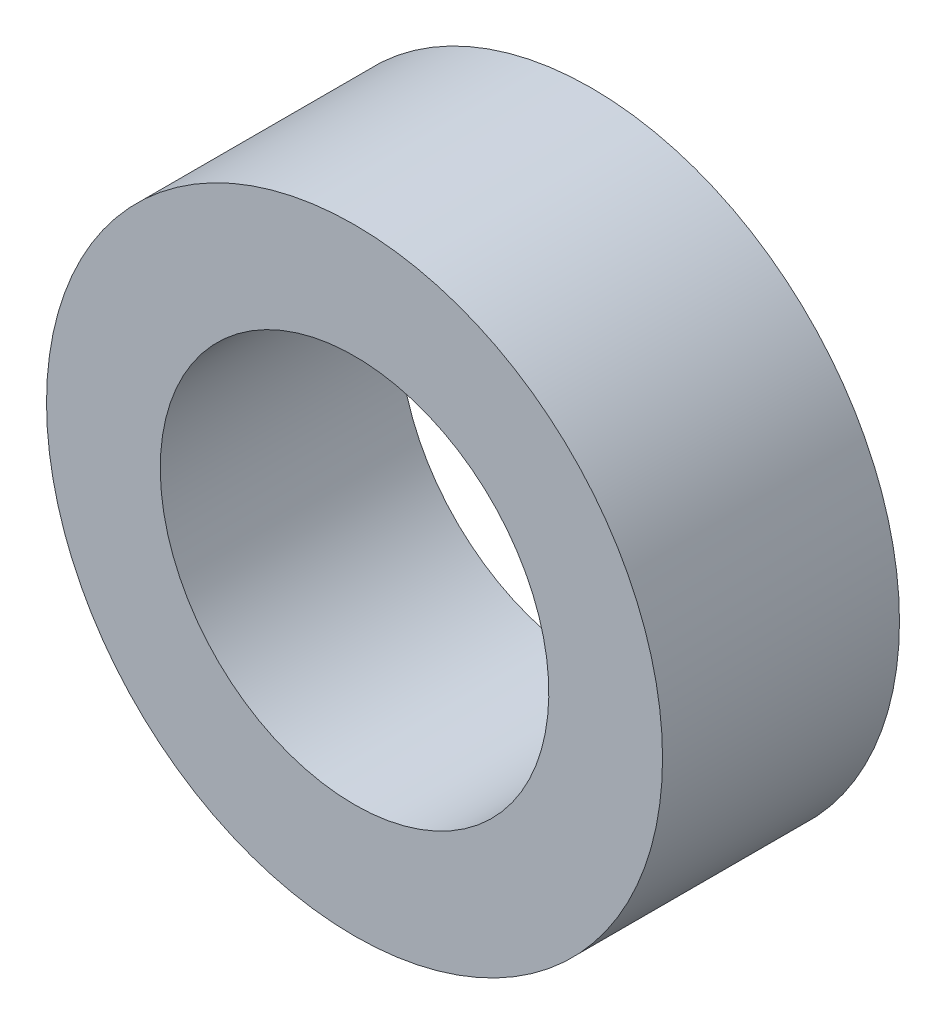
ISO-10303-21;
HEADER;
FILE_DESCRIPTION(('STEP AP214'),'2;1');
FILE_NAME('part.step','',(''),(''),'','','');
FILE_SCHEMA(('AUTOMOTIVE_DESIGN { 1 0 10303 214 1 1 1 1 }'));
ENDSEC;
DATA;
#1=APPLICATION_CONTEXT('core data for automotive mechanical design processes');
#2=APPLICATION_PROTOCOL_DEFINITION('international standard','automotive_design',2000,#1);
#3=PRODUCT_CONTEXT('',#1,'mechanical');
#4=PRODUCT('Part','Part','',(#3));
#5=PRODUCT_RELATED_PRODUCT_CATEGORY('part','',(#4));
#6=PRODUCT_DEFINITION_FORMATION('','',#4);
#7=PRODUCT_DEFINITION_CONTEXT('part definition',#1,'design');
#8=PRODUCT_DEFINITION('design','',#6,#7);
#9=PRODUCT_DEFINITION_SHAPE('','',#8);
#10=(LENGTH_UNIT() NAMED_UNIT(*) SI_UNIT(.MILLI.,.METRE.));
#11=(NAMED_UNIT(*) PLANE_ANGLE_UNIT() SI_UNIT($,.RADIAN.));
#12=(NAMED_UNIT(*) SI_UNIT($,.STERADIAN.) SOLID_ANGLE_UNIT());
#13=UNCERTAINTY_MEASURE_WITH_UNIT(LENGTH_MEASURE(1.E-05),#10,'distance_accuracy_value','');
#14=(GEOMETRIC_REPRESENTATION_CONTEXT(3) GLOBAL_UNCERTAINTY_ASSIGNED_CONTEXT((#13)) GLOBAL_UNIT_ASSIGNED_CONTEXT((#10,
#11,#12)) REPRESENTATION_CONTEXT('',''));
#15=CARTESIAN_POINT('',(0.,0.,0.));
#16=DIRECTION('',(0.,0.,1.));
#17=DIRECTION('',(1.,0.,0.));
#18=AXIS2_PLACEMENT_3D('',#15,#16,#17);
#19=CARTESIAN_POINT('',(-172.475837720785,535.693154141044,20.0675138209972));
#20=DIRECTION('',(0.,0.,-1.));
#21=DIRECTION('',(-1.,0.,0.));
#22=AXIS2_PLACEMENT_3D('',#19,#20,#21);
#23=CYLINDRICAL_SURFACE('',#22,5.3094929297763);
#24=CARTESIAN_POINT('',(-172.475837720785,535.693154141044,0.));
#25=DIRECTION('',(0.,0.,1.));
#26=DIRECTION('',(1.,0.,0.));
#27=AXIS2_PLACEMENT_3D('',#24,#25,#26);
#28=CIRCLE('',#27,5.3094929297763);
#29=CARTESIAN_POINT('',(-167.166344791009,535.693154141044,0.));
#30=VERTEX_POINT('',#29);
#31=EDGE_CURVE('E48',#30,#30,#28,.T.);
#32=ORIENTED_EDGE('',*,*,#31,.T.);
#33=EDGE_LOOP('',(#32));
#34=FACE_BOUND('',#33,.T.);
#35=CARTESIAN_POINT('',(-172.475837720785,535.693154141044,0.0499999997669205));
#36=DIRECTION('',(0.,0.,1.));
#37=DIRECTION('',(1.,0.,0.));
#38=AXIS2_PLACEMENT_3D('',#35,#36,#37);
#39=CIRCLE('',#38,5.3094929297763);
#40=CARTESIAN_POINT('',(-167.166344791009,535.693154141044,0.0499999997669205));
#41=VERTEX_POINT('',#40);
#42=EDGE_CURVE('E10',#41,#41,#39,.T.);
#43=ORIENTED_EDGE('',*,*,#42,.F.);
#44=EDGE_LOOP('',(#43));
#45=FACE_BOUND('',#44,.T.);
#46=ADVANCED_FACE('F41',(#34,#45),#23,.T.);
#47=CARTESIAN_POINT('',(-172.475837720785,535.693154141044,0.));
#48=DIRECTION('',(0.,0.,1.));
#49=DIRECTION('',(1.,0.,0.));
#50=AXIS2_PLACEMENT_3D('',#47,#48,#49);
#51=PLANE('',#50);
#52=ORIENTED_EDGE('',*,*,#31,.F.);
#53=EDGE_LOOP('',(#52));
#54=FACE_BOUND('',#53,.T.);
#55=CARTESIAN_POINT('',(-172.475837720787,535.69315414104,0.));
#56=DIRECTION('',(0.,0.,1.));
#57=DIRECTION('',(1.,0.,0.));
#58=AXIS2_PLACEMENT_3D('',#55,#56,#57);
#59=CIRCLE('',#58,4.10000000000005);
#60=CARTESIAN_POINT('',(-168.375837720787,535.69315414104,0.));
#61=VERTEX_POINT('',#60);
#62=EDGE_CURVE('E53',#61,#61,#59,.T.);
#63=ORIENTED_EDGE('',*,*,#62,.T.);
#64=EDGE_LOOP('',(#63));
#65=FACE_BOUND('',#64,.T.);
#66=ADVANCED_FACE('F84',(#54,#65),#51,.F.);
#67=CARTESIAN_POINT('',(-172.475837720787,535.69315414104,20.0675138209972));
#68=DIRECTION('',(0.,0.,-1.));
#69=DIRECTION('',(-1.,0.,0.));
#70=AXIS2_PLACEMENT_3D('',#67,#68,#69);
#71=CYLINDRICAL_SURFACE('',#70,4.10000000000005);
#72=CARTESIAN_POINT('',(-172.475837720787,535.69315414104,5.0499999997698));
#73=DIRECTION('',(0.,0.,1.));
#74=DIRECTION('',(0.,-1.,0.));
#75=AXIS2_PLACEMENT_3D('',#72,#73,#74);
#76=CIRCLE('',#75,4.10000000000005);
#77=CARTESIAN_POINT('',(-172.475837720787,531.59315414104,5.04999999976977));
#78=VERTEX_POINT('',#77);
#79=EDGE_CURVE('E44',#78,#78,#76,.T.);
#80=ORIENTED_EDGE('',*,*,#79,.T.);
#81=EDGE_LOOP('',(#80));
#82=FACE_BOUND('',#81,.T.);
#83=ORIENTED_EDGE('',*,*,#62,.F.);
#84=EDGE_LOOP('',(#83));
#85=FACE_BOUND('',#84,.T.);
#86=ADVANCED_FACE('F91',(#82,#85),#71,.F.);
#87=CARTESIAN_POINT('',(-165.239430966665,534.368470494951,5.04999999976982));
#88=DIRECTION('',(0.,0.,1.));
#89=DIRECTION('',(-0.56822287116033,0.822874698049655,0.));
#90=AXIS2_PLACEMENT_3D('',#87,#88,#89);
#91=PLANE('',#90);
#92=ORIENTED_EDGE('',*,*,#79,.F.);
#93=EDGE_LOOP('',(#92));
#94=FACE_BOUND('',#93,.T.);
#95=CARTESIAN_POINT('',(-172.475837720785,535.693154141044,5.04999999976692));
#96=DIRECTION('',(0.,0.,1.));
#97=DIRECTION('',(1.,0.,0.));
#98=AXIS2_PLACEMENT_3D('',#95,#96,#97);
#99=CIRCLE('',#98,6.50000000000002);
#100=CARTESIAN_POINT('',(-165.975837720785,535.693154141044,5.04999999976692));
#101=VERTEX_POINT('',#100);
#102=EDGE_CURVE('E56',#101,#101,#99,.T.);
#103=ORIENTED_EDGE('',*,*,#102,.T.);
#104=EDGE_LOOP('',(#103));
#105=FACE_BOUND('',#104,.T.);
#106=ADVANCED_FACE('F71',(#94,#105),#91,.T.);
#107=CARTESIAN_POINT('',(-172.475837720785,535.693154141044,0.0499999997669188));
#108=DIRECTION('',(0.,0.,1.));
#109=DIRECTION('',(1.,0.,0.));
#110=AXIS2_PLACEMENT_3D('',#107,#108,#109);
#111=PLANE('',#110);
#112=CARTESIAN_POINT('',(-172.475837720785,535.693154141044,0.0499999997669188));
#113=DIRECTION('',(0.,0.,1.));
#114=DIRECTION('',(1.,0.,0.));
#115=AXIS2_PLACEMENT_3D('',#112,#113,#114);
#116=CIRCLE('',#115,6.50000000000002);
#117=CARTESIAN_POINT('',(-165.975837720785,535.693154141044,0.0499999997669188));
#118=VERTEX_POINT('',#117);
#119=EDGE_CURVE('E62',#118,#118,#116,.T.);
#120=ORIENTED_EDGE('',*,*,#119,.F.);
#121=EDGE_LOOP('',(#120));
#122=FACE_BOUND('',#121,.T.);
#123=ORIENTED_EDGE('',*,*,#42,.T.);
#124=EDGE_LOOP('',(#123));
#125=FACE_BOUND('',#124,.T.);
#126=ADVANCED_FACE('F75',(#122,#125),#111,.F.);
#127=CARTESIAN_POINT('',(-172.475837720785,535.693154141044,0.0499999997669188));
#128=DIRECTION('',(0.,0.,1.));
#129=DIRECTION('',(1.,0.,0.));
#130=AXIS2_PLACEMENT_3D('',#127,#128,#129);
#131=CYLINDRICAL_SURFACE('',#130,6.50000000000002);
#132=ORIENTED_EDGE('',*,*,#119,.T.);
#133=EDGE_LOOP('',(#132));
#134=FACE_BOUND('',#133,.T.);
#135=ORIENTED_EDGE('',*,*,#102,.F.);
#136=EDGE_LOOP('',(#135));
#137=FACE_BOUND('',#136,.T.);
#138=ADVANCED_FACE('F73',(#134,#137),#131,.T.);
#139=CLOSED_SHELL('',(#46,#66,#86,#106,#126,#138));
#140=MANIFOLD_SOLID_BREP('B2',#139);
#141=ADVANCED_BREP_SHAPE_REPRESENTATION('',(#18,#140),#14);
#142=SHAPE_DEFINITION_REPRESENTATION(#9,#141);
ENDSEC;
END-ISO-10303-21;
